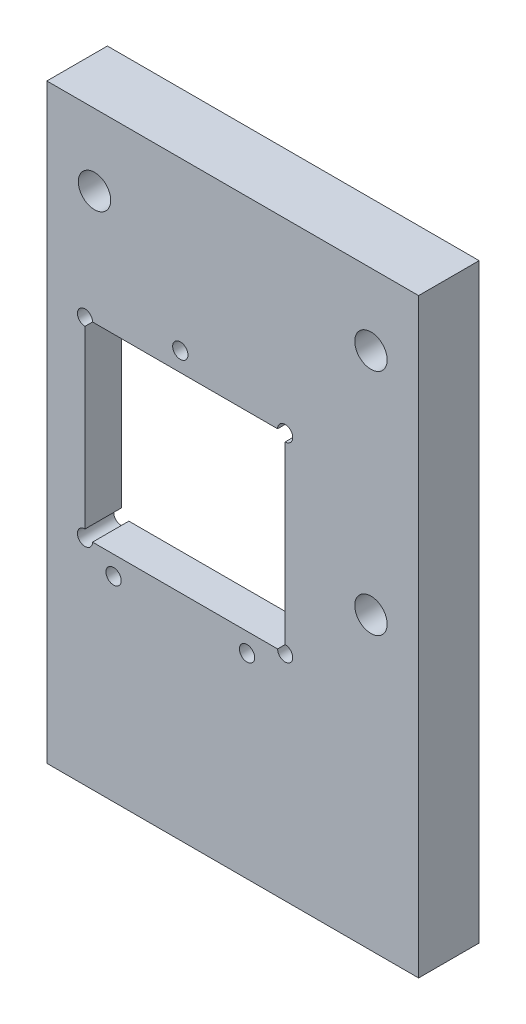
from build123d import *

# Parameters (mm, degrees)
SKETCH1_W                      = 39
SKETCH1_H                      = 62
BOSS_EXTRUDE1_DEPTH            = 6.35
M2X0_4_TAPPED_HOLE1_D          = 1.6
SKETCH3_W                      = 21
SKETCH3_H                      = 20
CUT_EXTRUDE1_DEPTH             = 38.169510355
F_1_16_0_0625_DOWEL_HOLE1_D    = 1.5875
SKETCH9_R                      = 1.7
CUT_EXTRUDE2_DEPTH             = 38.169510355
SKETCH11_W                     = 31
SKETCH11_H                     = 31
CUT_EXTRUDE3_DEPTH             = 2.54
FILLET1_R                      = 1
F_1_8_0_1250_DOWEL_HOLE2_D     = 3.175
F_1_8_0_1250_DOWEL_HOLE2_DEPTH = 6.35
F_1_8_0_1250_DOWEL_HOLE2_TIP   = 0.953866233
TAP_DRILL_FOR_4_40_TAP1_D      = 2.2606
TAP_DRILL_FOR_4_40_TAP1_DEPTH  = 12.7
TAP_DRILL_FOR_4_40_TAP1_TIP    = 0.679152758


with BuildPart() as part:
    # Sketch1 → Boss-Extrude1 (new body)
    with BuildSketch(Plane.XY):
        Rectangle(SKETCH1_W, SKETCH1_H)
    extrude(amount=BOSS_EXTRUDE1_DEPTH)

    # M2x0.4 Tapped Hole1 (through all)
    with Locations(Plane(origin=(-5.5, 13.5, 6.35), x_dir=(1, 0, 0), z_dir=(0, 0, 1))):
        with Locations((0, 0), (-7, -24), (7, -24)):
            Hole(M2X0_4_TAPPED_HOLE1_D / 2)

    # Sketch3 → Cut-Extrude1 (cut, through all)
    with BuildSketch(Plane.XY.offset(6.35)):
        with Locations((-5, 1.5)):
            Rectangle(SKETCH3_W, SKETCH3_H)
    extrude(amount=-CUT_EXTRUDE1_DEPTH, mode=Mode.SUBTRACT)

    # 1_16 _0.0625_ Dowel Hole1 (through all)
    with Locations(Plane(origin=(-15.5, 11.5, 6.35), x_dir=(1, 0, 0), z_dir=(0, 0, 1))):
        with Locations((0, 0), (21, 0), (21, -20), (0, -20)):
            Hole(F_1_16_0_0625_DOWEL_HOLE1_D / 2)

    # Sketch9 → Cut-Extrude2 (cut, through all)
    with BuildSketch(Plane.XY.offset(6.35)):
        with Locations((14.5, -0.5)):
            Circle(SKETCH9_R)
        with Locations((14.5, 23.5)):
            Circle(SKETCH9_R)
        with Locations((-14.5, 23.5)):
            Circle(SKETCH9_R)
    extrude(amount=-CUT_EXTRUDE2_DEPTH, mode=Mode.SUBTRACT)

    # Sketch11 → Cut-Extrude3 (cut)
    with BuildSketch(Plane(origin=(0, 0, 0), x_dir=(-1, 0, 0), z_dir=(0, 0, -1))):
        with Locations((5, 1.5)):
            Rectangle(SKETCH11_W, SKETCH11_H)
    extrude(amount=-CUT_EXTRUDE3_DEPTH, mode=Mode.SUBTRACT)

    # Fillet1
    fillet1_edges = [part.edges().sort_by_distance(p)[0] for p in [
        (10.5, 17, 1.27),
        (10.5, -14, 1.27),
    ]]
    fillet(fillet1_edges, radius=FILLET1_R)

    # 1_8 _0.1250_ Dowel Hole2
    with Locations(Plane(origin=(-6.8, -31, 3.175), x_dir=(0, 0, -1), z_dir=(0, -1, 0))):
        with Locations((0, 0), (0, 13.6)):
            Hole(F_1_8_0_1250_DOWEL_HOLE2_D / 2, depth=F_1_8_0_1250_DOWEL_HOLE2_DEPTH)
            with Locations((0, 0, -(F_1_8_0_1250_DOWEL_HOLE2_DEPTH + F_1_8_0_1250_DOWEL_HOLE2_TIP / 2))):  # 118° drill point
                Cone(0, F_1_8_0_1250_DOWEL_HOLE2_D / 2, F_1_8_0_1250_DOWEL_HOLE2_TIP, mode=Mode.SUBTRACT)

    # Tap Drill for _4-40 Tap1
    with Locations(Plane(origin=(-13.15, -31, 3.175), x_dir=(0, 0, -1), z_dir=(0, -1, 0))):
        with Locations((0, 0), (0, 26.3)):
            Hole(TAP_DRILL_FOR_4_40_TAP1_D / 2, depth=TAP_DRILL_FOR_4_40_TAP1_DEPTH)
            with Locations((0, 0, -(TAP_DRILL_FOR_4_40_TAP1_DEPTH + TAP_DRILL_FOR_4_40_TAP1_TIP / 2))):  # 118° drill point
                Cone(0, TAP_DRILL_FOR_4_40_TAP1_D / 2, TAP_DRILL_FOR_4_40_TAP1_TIP, mode=Mode.SUBTRACT)


solid = part.part
